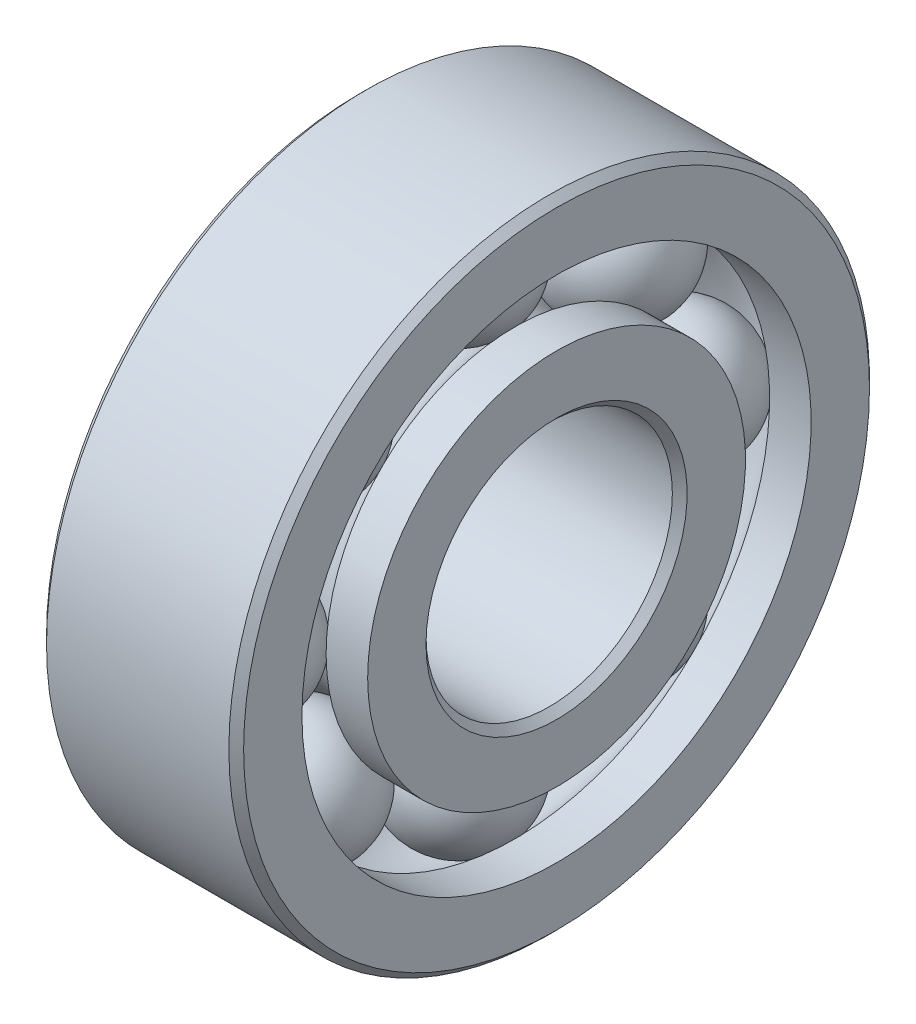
from build123d import *

# Parameters (mm, degrees)
SZYK_KO_OWY1_COUNT = 8
SFAZOWANIE1_SIZE   = 0.3
SFAZOWANIE2_SIZE   = 0.3


with BuildPart() as part:
    # Szkic1 → Obr_t1 (revolve)
    with BuildSketch(Plane.XY, mode=Mode.PRIVATE) as obr_t1_sk:
        with BuildLine():
            Line((-4, 5), (4, 5))
            Line((4, 5), (4, 7.666666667))
            Line((4, 7.666666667), (2.313249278, 7.666666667))
            ThreePointArc((2.313249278, 7.666666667), (0, 6.33), (-2.313249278, 7.666666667))
            Line((-2.313249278, 7.666666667), (-4, 7.666666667))
            Line((-4, 7.666666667), (-4, 5))
        make_face()
        with BuildLine():
            Line((-4, 10.333333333), (-2.313249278, 10.333333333))
            ThreePointArc((-2.313249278, 10.333333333), (0, 11.67), (2.313249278, 10.333333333))
            Line((2.313249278, 10.333333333), (4, 10.333333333))
            Line((4, 10.333333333), (4, 13))
            Line((4, 13), (-4, 13))
            Line((-4, 13), (-4, 10.333333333))
        make_face()
    revolve(obr_t1_sk.sketch.rotate(Axis((-4, 0, 0), (1, 0, 0)), 90), axis=Axis((-4, 0, 0), (1, 0, 0)))

    # Sfazowanie1
    sfazowanie1_edges = [part.edges().sort_by_distance(p)[0] for p in [
        (-4, 0, -13),
        (4, 0, -13),
    ]]
    chamfer(sfazowanie1_edges, length=SFAZOWANIE1_SIZE)

    # Sfazowanie2
    sfazowanie2_edges = [part.edges().sort_by_distance(p)[0] for p in [
        (4, 0, -5),
        (-4, 0, -5),
    ]]
    chamfer(sfazowanie2_edges, length=SFAZOWANIE2_SIZE)


with BuildPart() as body_2:
    # Szkic2 → Kulka (revolve)
    with BuildSketch(Plane.XY):
        with BuildLine():
            Line((-2.67, 9), (2.67, 9))
            ThreePointArc((2.67, 9), (0, 11.67), (-2.67, 9))
        make_face()
    revolve(axis=Axis((-2.67, 9, 0), (1, 0, 0)))


with BuildPart() as szyk_ko_owy1_1:
    # Szyk ko_owy1: pattern copy
    add(body_2.part.rotate(Axis((0, 0, 0), (1, 0, 0)), 1 * 360 / SZYK_KO_OWY1_COUNT))


with BuildPart() as szyk_ko_owy1_2:
    # Szyk ko_owy1: pattern copy
    add(body_2.part.rotate(Axis((0, 0, 0), (1, 0, 0)), 2 * 360 / SZYK_KO_OWY1_COUNT))


with BuildPart() as szyk_ko_owy1_3:
    # Szyk ko_owy1: pattern copy
    add(body_2.part.rotate(Axis((0, 0, 0), (1, 0, 0)), 3 * 360 / SZYK_KO_OWY1_COUNT))


with BuildPart() as szyk_ko_owy1_4:
    # Szyk ko_owy1: pattern copy
    add(body_2.part.rotate(Axis((0, 0, 0), (1, 0, 0)), 4 * 360 / SZYK_KO_OWY1_COUNT))


with BuildPart() as szyk_ko_owy1_5:
    # Szyk ko_owy1: pattern copy
    add(body_2.part.rotate(Axis((0, 0, 0), (1, 0, 0)), 5 * 360 / SZYK_KO_OWY1_COUNT))


with BuildPart() as szyk_ko_owy1_6:
    # Szyk ko_owy1: pattern copy
    add(body_2.part.rotate(Axis((0, 0, 0), (1, 0, 0)), 6 * 360 / SZYK_KO_OWY1_COUNT))


with BuildPart() as szyk_ko_owy1_7:
    # Szyk ko_owy1: pattern copy
    add(body_2.part.rotate(Axis((0, 0, 0), (1, 0, 0)), 7 * 360 / SZYK_KO_OWY1_COUNT))


solid = Compound([part.part, body_2.part, szyk_ko_owy1_1.part, szyk_ko_owy1_2.part, szyk_ko_owy1_3.part, szyk_ko_owy1_4.part, szyk_ko_owy1_5.part, szyk_ko_owy1_6.part, szyk_ko_owy1_7.part])
